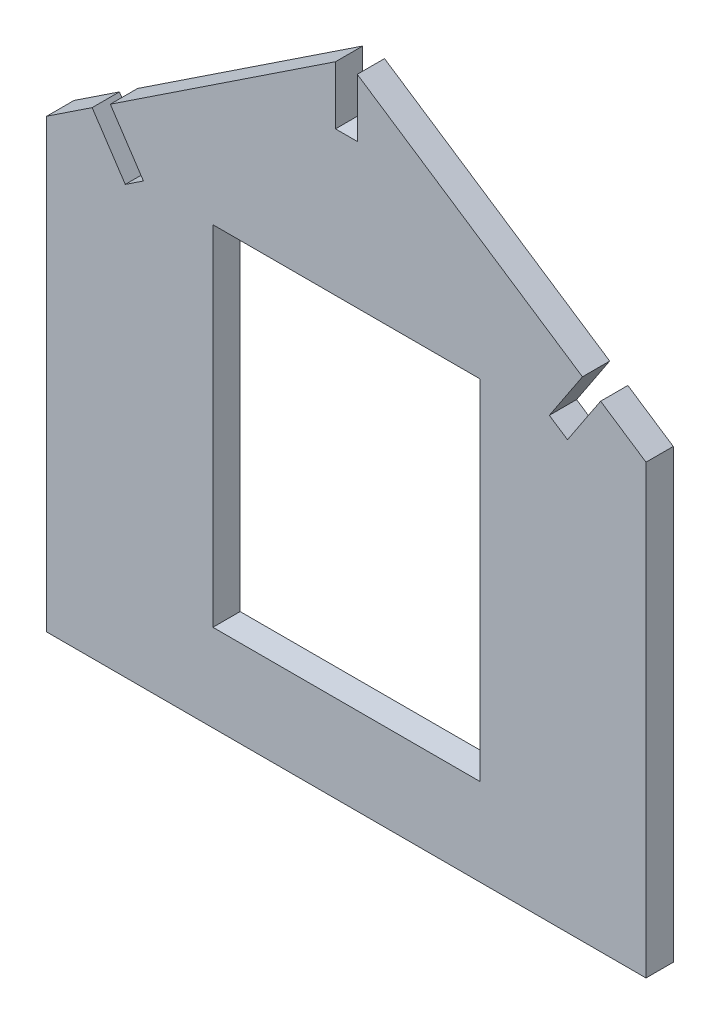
from build123d import *

# Parameters (mm, degrees)
ESQUISSE1_W             = 49
ESQUISSE1_H             = 64
EXTRUSION1_DEPTH        = 5
ESQUISSE2_W             = 4
ESQUISSE2_H             = 9.4903707
ENL_V_MAT_EXTRU_1_DEPTH = 11
ESQUISSE3_W             = 4
ESQUISSE3_H             = 10.059792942
ENL_V_MAT_EXTRU_2_DEPTH = 11
ESQUISSE4_W             = 4
ESQUISSE4_H             = 9.644927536
ENL_V_MAT_EXTRU_4_DEPTH = 12


with BuildPart() as part:
    # Esquisse1 → Extrusion1 (new body)
    with BuildSketch(Plane.XY):
        Polygon((-55, 41), (0, 77.482872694), (55, 41), (55, -41), (-55, -41), align=None)
        with Locations((0, 7)):
            Rectangle(ESQUISSE1_W, ESQUISSE1_H, mode=Mode.SUBTRACT)
    extrude(amount=-EXTRUSION1_DEPTH)

    # Esquisse2 → Enl_v. mat.-Extru.1 (cut)
    with BuildSketch(Plane(origin=(-35.691891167, 53.807550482, 0), x_dir=(-0.8333333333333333, -0.5527707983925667, 0), z_dir=(-0.5527707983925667, 0.8333333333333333, 0))):
        with Locations((11.169730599, -3.164325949)):
            Rectangle(ESQUISSE2_W, ESQUISSE2_H)
    extrude(amount=-ENL_V_MAT_EXTRU_1_DEPTH, mode=Mode.SUBTRACT)

    # Esquisse3 → Enl_v. mat.-Extru.2 (cut)
    with BuildSketch(Plane(origin=(35.691891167, 53.807550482, 0), x_dir=(-0.8333333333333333, 0.5527707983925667, 0), z_dir=(0.5527707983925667, 0.8333333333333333, 0))):
        with Locations((-11.169730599, -2.879614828)):
            Rectangle(ESQUISSE3_W, ESQUISSE3_H)
    extrude(amount=-ENL_V_MAT_EXTRU_2_DEPTH, mode=Mode.SUBTRACT)

    # Esquisse4 → Enl_v. mat.-Extru.4 (cut)
    with BuildSketch(Plane.XZ.offset(-77.482872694)):
        with Locations((0, -2.426932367)):
            Rectangle(ESQUISSE4_W, ESQUISSE4_H)
    extrude(amount=ENL_V_MAT_EXTRU_4_DEPTH, mode=Mode.SUBTRACT)


solid = part.part
